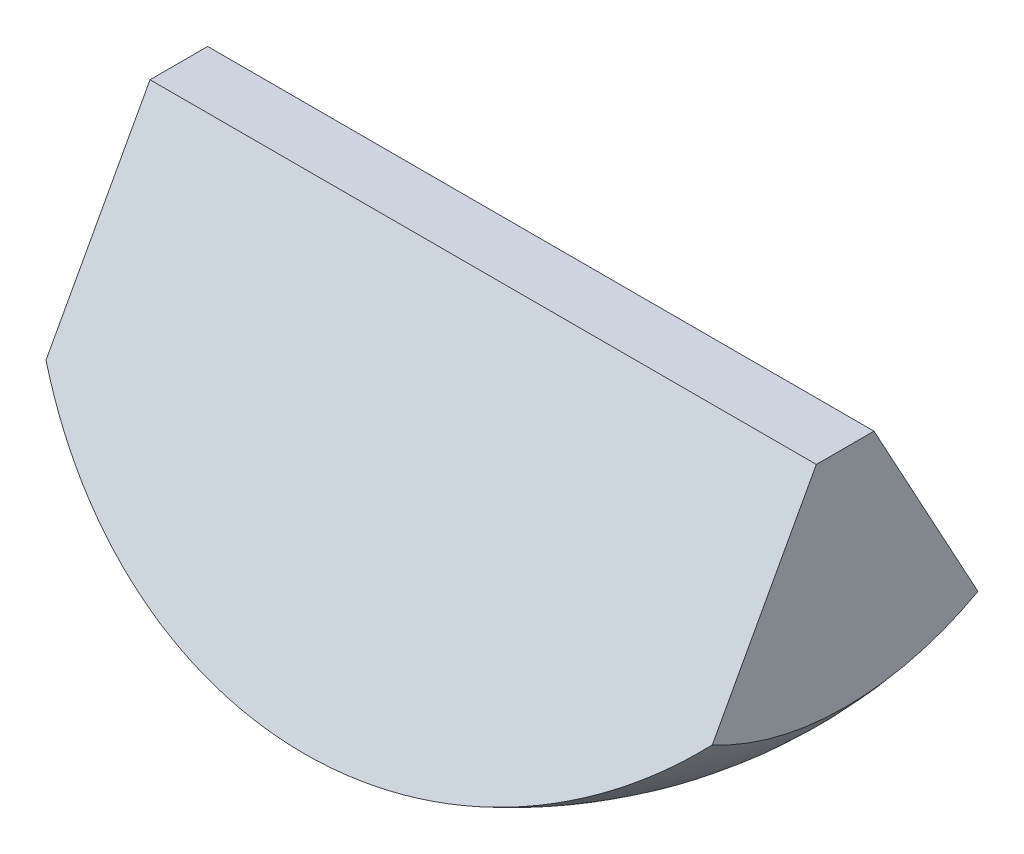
from build123d import *

# Parameters (mm, degrees)
SKETCH_5_W          = 154.845426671
SKETCH_5_H          = 65.677471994
CUT_EXTRUDE_2_DEPTH = 50
CUT_EXTRUDE_3_DEPTH = 95
SKETCH_7_OUTSIDE_W  = 105.196
SKETCH_7_OUTSIDE_H  = 59.808
CUT_EXTRUDE_4_DEPTH = 120


with BuildPart() as part:
    # Sketch 2 → Revolve 1 (revolve)
    with BuildSketch(Plane.XY):
        with BuildLine():
            Line((0, 41), (0, -41))
            ThreePointArc((0, -41), (41, 0), (0, 41))
        make_face()
    revolve(axis=Axis((0, 41, 0), (0, -1, 0)))

    # Sketch 5 → Cut-Extrude 2 (cut, symmetric)
    with BuildSketch(Plane.XY):
        with Locations((12.046314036, 27.838735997)):
            Rectangle(SKETCH_5_W, SKETCH_5_H)
    extrude(amount=CUT_EXTRUDE_2_DEPTH, both=True, mode=Mode.SUBTRACT)

    # Sketch 6 → Cut-Extrude 3 (cut, symmetric)
    with BuildSketch(Plane(origin=(0, -5, 0), x_dir=(1, 0, 0), z_dir=(0, 1, 0))):
        Polygon((-31.5, 34.928867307), (-31.5, -35.457291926), (-61.19746358, -1.321061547), align=None)
        Polygon((31.5, 34.928867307), (31.5, -41.904072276), (60.986093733, -2.80065048), align=None)
    extrude(amount=CUT_EXTRUDE_3_DEPTH, both=True, mode=Mode.SUBTRACT)

    # Sketch 7 outside → Cut-Extrude 4 (cut, symmetric)
    with BuildSketch(Plane(origin=(0, 0, 0), x_dir=(0, 0, -1), z_dir=(1, 0, 0))):
        with Locations((0, -23)):
            Rectangle(SKETCH_7_OUTSIDE_W, SKETCH_7_OUTSIDE_H)
        Polygon((0, 0), (19.62141687, -36), (19.62141687, -53.502110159), (-19.62141687, -53.502110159), (-19.62141687, -36), align=None, mode=Mode.SUBTRACT)
    extrude(amount=CUT_EXTRUDE_4_DEPTH, both=True, mode=Mode.SUBTRACT)


solid = part.part
